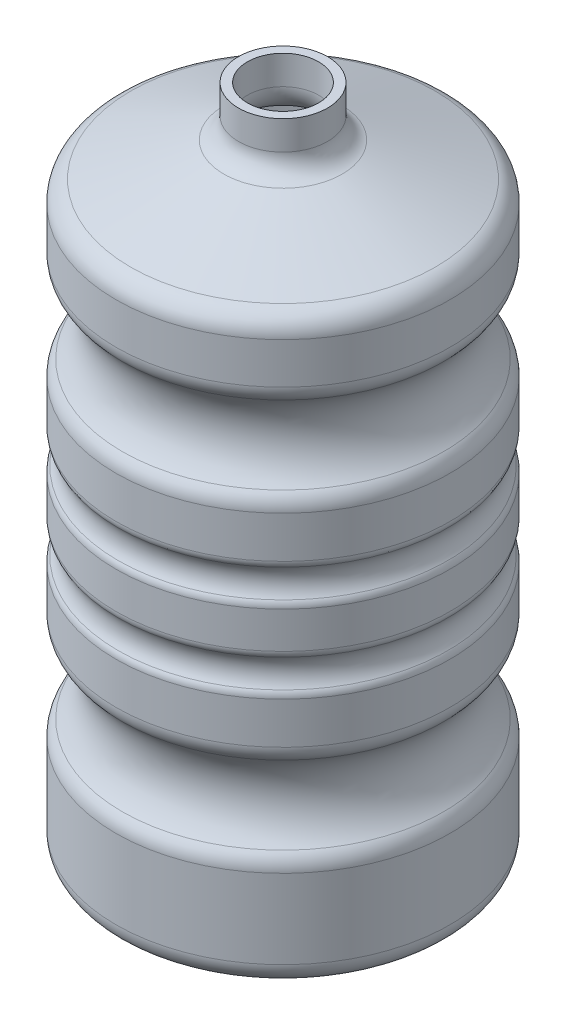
from build123d import *

# Parameters (mm, degrees)
FILLET1_R = 10
FILLET2_R = 5
SHELL1_T  = -4


with BuildPart() as part:
    # Sketch1 → Revolve1 (revolve)
    with BuildSketch(Plane(origin=(0, 0, 0), x_dir=(0, 0, -1), z_dir=(1, 0, 0))):
        with BuildLine():
            Line((0, 10), (0, 300))
            Line((0, 300), (20, 300))
            Line((20, 300), (20, 280))
            Line((20, 280), (75, 259.981637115))
            Line((75, 259.981637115), (75, 230))
            ThreePointArc((75, 230), (65, 210), (75, 190))
            Line((75, 190), (75, 165))
            ThreePointArc((75, 165), (72, 157.5), (75, 150))
            Line((75, 150), (75, 130))
            ThreePointArc((75, 130), (72, 122.5), (75, 115))
            Line((75, 115), (75, 90))
            ThreePointArc((75, 90), (65, 70), (75, 50))
            Line((75, 50), (75, 0))
            Line((75, 0), (40, 0))
            ThreePointArc((40, 0), (20.615528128, 7.462112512), (0, 10))
        make_face()
    revolve(axis=Axis((0, 10, 0), (0, 1, 0)))

    # Fillet1
    fillet1_edges = [part.edges().sort_by_distance(p)[0] for p in [
        (0, 280, 20),
        (0, 259.981637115, 75),
        (0, 230, 75),
        (0, 190, 75),
        (0, 90, 75),
        (0, 50, 75),
        (0, 0, 75),
    ]]
    fillet(fillet1_edges, radius=FILLET1_R)

    # Fillet2
    fillet2_edges = [part.edges().sort_by_distance(p)[0] for p in [
        (0, 165, 75),
        (0, 150, 75),
        (0, 130, 75),
        (0, 115, 75),
    ]]
    fillet(fillet2_edges, radius=FILLET2_R)

    # Shell1
    shell1_openings = [part.faces().sort_by_distance(p)[0] for p in [
        (0, 300, 0),
    ]]
    offset(amount=SHELL1_T, openings=shell1_openings, kind=Kind.INTERSECTION)


solid = part.part
